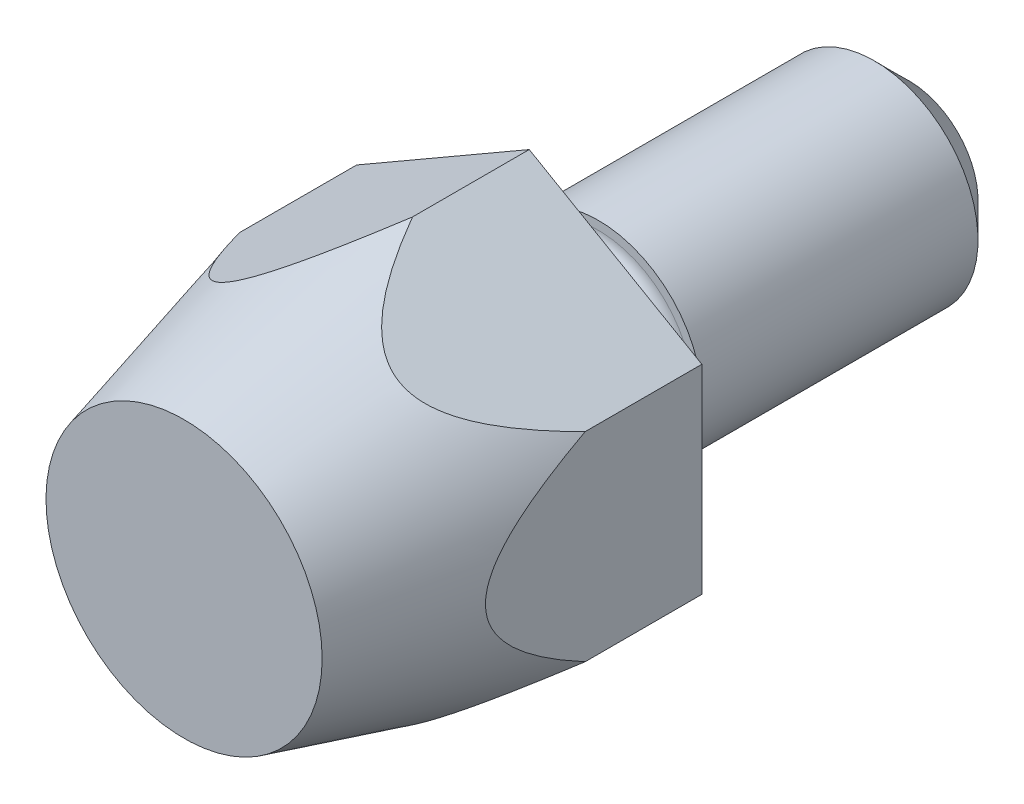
ISO-10303-21;
HEADER;
FILE_DESCRIPTION(('STEP AP214'),'2;1');
FILE_NAME('part.step','',(''),(''),'','','');
FILE_SCHEMA(('AUTOMOTIVE_DESIGN { 1 0 10303 214 1 1 1 1 }'));
ENDSEC;
DATA;
#1=APPLICATION_CONTEXT('core data for automotive mechanical design processes');
#2=APPLICATION_PROTOCOL_DEFINITION('international standard','automotive_design',2000,#1);
#3=PRODUCT_CONTEXT('',#1,'mechanical');
#4=PRODUCT('Part','Part','',(#3));
#5=PRODUCT_RELATED_PRODUCT_CATEGORY('part','',(#4));
#6=PRODUCT_DEFINITION_FORMATION('','',#4);
#7=PRODUCT_DEFINITION_CONTEXT('part definition',#1,'design');
#8=PRODUCT_DEFINITION('design','',#6,#7);
#9=PRODUCT_DEFINITION_SHAPE('','',#8);
#10=(LENGTH_UNIT() NAMED_UNIT(*) SI_UNIT(.MILLI.,.METRE.));
#11=(NAMED_UNIT(*) PLANE_ANGLE_UNIT() SI_UNIT($,.RADIAN.));
#12=(NAMED_UNIT(*) SI_UNIT($,.STERADIAN.) SOLID_ANGLE_UNIT());
#13=UNCERTAINTY_MEASURE_WITH_UNIT(LENGTH_MEASURE(1.E-05),#10,'distance_accuracy_value','');
#14=(GEOMETRIC_REPRESENTATION_CONTEXT(3) GLOBAL_UNCERTAINTY_ASSIGNED_CONTEXT((#13)) GLOBAL_UNIT_ASSIGNED_CONTEXT((#10,
#11,#12)) REPRESENTATION_CONTEXT('',''));
#15=CARTESIAN_POINT('',(0.,0.,0.));
#16=DIRECTION('',(0.,0.,1.));
#17=DIRECTION('',(1.,0.,0.));
#18=AXIS2_PLACEMENT_3D('',#15,#16,#17);
#19=CARTESIAN_POINT('',(-6.67949192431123,0.,0.));
#20=DIRECTION('',(0.,0.,-1.));
#21=DIRECTION('',(-1.,0.,0.));
#22=AXIS2_PLACEMENT_3D('',#19,#20,#21);
#23=PLANE('',#22);
#24=CARTESIAN_POINT('',(0.,0.,0.));
#25=DIRECTION('',(0.,0.,-1.));
#26=DIRECTION('',(-1.,0.,0.));
#27=AXIS2_PLACEMENT_3D('',#24,#25,#26);
#28=CIRCLE('',#27,2.75);
#29=CARTESIAN_POINT('',(-2.75,0.,0.));
#30=VERTEX_POINT('',#29);
#31=EDGE_CURVE('E9',#30,#30,#28,.F.);
#32=ORIENTED_EDGE('',*,*,#31,.T.);
#33=EDGE_LOOP('',(#32));
#34=FACE_BOUND('',#33,.T.);
#35=DIRECTION('',(0.,1.,0.));
#36=VECTOR('',#35,1.);
#37=CARTESIAN_POINT('',(5.,-2.88675134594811,0.));
#38=LINE('',#37,#36);
#39=CARTESIAN_POINT('',(5.,-2.88675134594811,0.));
#40=VERTEX_POINT('',#39);
#41=CARTESIAN_POINT('',(5.,2.88675134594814,0.));
#42=VERTEX_POINT('',#41);
#43=EDGE_CURVE('E97',#40,#42,#38,.T.);
#44=ORIENTED_EDGE('',*,*,#43,.F.);
#45=DIRECTION('',(-0.866025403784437,-0.5,0.));
#46=VECTOR('',#45,1.);
#47=CARTESIAN_POINT('',(5.,-2.88675134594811,0.));
#48=LINE('',#47,#46);
#49=CARTESIAN_POINT('',(0.,-5.77350269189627,0.));
#50=VERTEX_POINT('',#49);
#51=EDGE_CURVE('E90',#40,#50,#48,.T.);
#52=ORIENTED_EDGE('',*,*,#51,.T.);
#53=DIRECTION('',(0.866025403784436,-0.5,0.));
#54=VECTOR('',#53,1.);
#55=CARTESIAN_POINT('',(-5.,-2.88675134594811,0.));
#56=LINE('',#55,#54);
#57=CARTESIAN_POINT('',(-5.,-2.88675134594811,0.));
#58=VERTEX_POINT('',#57);
#59=EDGE_CURVE('E88',#58,#50,#56,.T.);
#60=ORIENTED_EDGE('',*,*,#59,.F.);
#61=DIRECTION('',(0.,1.,0.));
#62=VECTOR('',#61,1.);
#63=CARTESIAN_POINT('',(-5.,-2.88675134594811,0.));
#64=LINE('',#63,#62);
#65=CARTESIAN_POINT('',(-5.,2.88675134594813,0.));
#66=VERTEX_POINT('',#65);
#67=EDGE_CURVE('E37',#58,#66,#64,.T.);
#68=ORIENTED_EDGE('',*,*,#67,.T.);
#69=DIRECTION('',(0.86602540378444,0.5,0.));
#70=VECTOR('',#69,1.);
#71=CARTESIAN_POINT('',(-5.,2.88675134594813,0.));
#72=LINE('',#71,#70);
#73=CARTESIAN_POINT('',(0.,5.77350269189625,0.));
#74=VERTEX_POINT('',#73);
#75=EDGE_CURVE('E77',#66,#74,#72,.T.);
#76=ORIENTED_EDGE('',*,*,#75,.T.);
#77=DIRECTION('',(-0.86602540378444,0.5,0.));
#78=VECTOR('',#77,1.);
#79=CARTESIAN_POINT('',(5.,2.88675134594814,0.));
#80=LINE('',#79,#78);
#81=EDGE_CURVE('E83',#42,#74,#80,.T.);
#82=ORIENTED_EDGE('',*,*,#81,.F.);
#83=EDGE_LOOP('',(#44,#52,#60,#68,#76,#82));
#84=FACE_BOUND('',#83,.T.);
#85=ADVANCED_FACE('F14',(#34,#84),#23,.T.);
#86=CARTESIAN_POINT('',(5.,-2.88675134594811,10.));
#87=DIRECTION('',(0.5,-0.866025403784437,0.));
#88=DIRECTION('',(0.866025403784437,0.5,0.));
#89=AXIS2_PLACEMENT_3D('',#86,#87,#88);
#90=PLANE('',#89);
#91=DIRECTION('',(0.,0.,-1.));
#92=VECTOR('',#91,1.);
#93=CARTESIAN_POINT('',(0.,-5.77350269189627,10.));
#94=LINE('',#93,#92);
#95=CARTESIAN_POINT('',(1.0797276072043E-13,-5.77350269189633,3.38119784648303));
#96=VERTEX_POINT('',#95);
#97=EDGE_CURVE('E29',#96,#50,#94,.T.);
#98=ORIENTED_EDGE('',*,*,#97,.T.);
#99=ORIENTED_EDGE('',*,*,#51,.F.);
#100=DIRECTION('',(0.,0.,-1.));
#101=VECTOR('',#100,1.);
#102=CARTESIAN_POINT('',(5.,-2.88675134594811,10.));
#103=LINE('',#102,#101);
#104=CARTESIAN_POINT('',(5.,-2.88675134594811,3.38119784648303));
#105=VERTEX_POINT('',#104);
#106=EDGE_CURVE('E102',#105,#40,#103,.T.);
#107=ORIENTED_EDGE('',*,*,#106,.F.);
#108=CARTESIAN_POINT('',(-0.000200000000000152,-5.77361816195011,3.38076689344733));
#109=CARTESIAN_POINT('',(0.0666130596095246,-5.73504362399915,3.52459966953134));
#110=CARTESIAN_POINT('',(0.134906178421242,-5.6956145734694,3.66756113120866));
#111=CARTESIAN_POINT('',(0.275434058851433,-5.61448076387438,3.9512236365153));
#112=CARTESIAN_POINT('',(0.347675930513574,-5.57277189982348,4.09191996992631));
#113=CARTESIAN_POINT('',(0.497724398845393,-5.48614137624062,4.3716408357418));
#114=CARTESIAN_POINT('',(0.575586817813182,-5.4411874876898,4.51062576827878));
#115=CARTESIAN_POINT('',(0.737356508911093,-5.34778971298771,4.78371916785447));
#116=CARTESIAN_POINT('',(0.82125889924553,-5.29934864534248,4.91783144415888));
#117=CARTESIAN_POINT('',(0.992140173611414,-5.20069029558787,5.17179045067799));
#118=CARTESIAN_POINT('',(1.07869243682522,-5.15071932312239,5.29201594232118));
#119=CARTESIAN_POINT('',(1.2610601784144,-5.04542925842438,5.5228063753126));
#120=CARTESIAN_POINT('',(1.35686724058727,-4.99011502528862,5.63337992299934));
#121=CARTESIAN_POINT('',(1.53855912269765,-4.88521516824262,5.81643057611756));
#122=CARTESIAN_POINT('',(1.62209200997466,-4.83698743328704,5.89196980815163));
#123=CARTESIAN_POINT('',(1.79796539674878,-4.73544688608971,6.02794447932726));
#124=CARTESIAN_POINT('',(1.89027927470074,-4.68214944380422,6.08842367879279));
#125=CARTESIAN_POINT('',(2.05171533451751,-4.58894429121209,6.17025464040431));
#126=CARTESIAN_POINT('',(2.11839657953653,-4.55044585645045,6.19793134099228));
#127=CARTESIAN_POINT('',(2.2547866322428,-4.4717010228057,6.24034007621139));
#128=CARTESIAN_POINT('',(2.3244912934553,-4.4314570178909,6.25508928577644));
#129=CARTESIAN_POINT('',(2.4655045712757,-4.35004296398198,6.26983805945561));
#130=CARTESIAN_POINT('',(2.53682005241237,-4.30886895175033,6.26975331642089));
#131=CARTESIAN_POINT('',(2.67824468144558,-4.22721740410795,6.25463898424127));
#132=CARTESIAN_POINT('',(2.74835306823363,-4.18674030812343,6.23960029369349));
#133=CARTESIAN_POINT('',(2.89986836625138,-4.09926291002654,6.19195134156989));
#134=CARTESIAN_POINT('',(2.98054352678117,-4.05268508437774,6.15630643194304));
#135=CARTESIAN_POINT('',(3.13596876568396,-3.96295028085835,6.07071198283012));
#136=CARTESIAN_POINT('',(3.2107048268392,-3.91980139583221,6.02072981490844));
#137=CARTESIAN_POINT('',(3.34625548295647,-3.84154118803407,5.91684973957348));
#138=CARTESIAN_POINT('',(3.4076932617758,-3.80607006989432,5.86400940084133));
#139=CARTESIAN_POINT('',(3.5264663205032,-3.73749641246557,5.75244799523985));
#140=CARTESIAN_POINT('',(3.58379786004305,-3.70439603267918,5.69372168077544));
#141=CARTESIAN_POINT('',(3.69525082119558,-3.64004863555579,5.57150783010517));
#142=CARTESIAN_POINT('',(3.74934683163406,-3.60881628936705,5.507989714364));
#143=CARTESIAN_POINT('',(3.85438937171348,-3.54816995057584,5.37764665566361));
#144=CARTESIAN_POINT('',(3.90533715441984,-3.51875523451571,5.31082304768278));
#145=CARTESIAN_POINT('',(4.06016343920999,-3.42936623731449,5.09835259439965));
#146=CARTESIAN_POINT('',(4.15942927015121,-3.37205508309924,4.94823125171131));
#147=CARTESIAN_POINT('',(4.34940257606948,-3.26237394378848,4.64077064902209));
#148=CARTESIAN_POINT('',(4.44009696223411,-3.21001151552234,4.48342087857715));
#149=CARTESIAN_POINT('',(4.61166845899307,-3.11095466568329,4.16988404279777));
#150=CARTESIAN_POINT('',(4.69278505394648,-3.06412197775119,4.01387074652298));
#151=CARTESIAN_POINT('',(4.81073224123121,-2.9960251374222,3.77774151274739));
#152=CARTESIAN_POINT('',(4.84936626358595,-2.97371977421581,3.69881159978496));
#153=CARTESIAN_POINT('',(4.9255584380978,-2.92973020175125,3.54027498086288));
#154=CARTESIAN_POINT('',(4.96311672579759,-2.90804591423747,3.46066836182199));
#155=CARTESIAN_POINT('',(5.00020000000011,-2.88663587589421,3.38076689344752));
#156=B_SPLINE_CURVE_WITH_KNOTS('',3,(#108,#109,#110,#111,#112,#113,#114,#115,#116,#117,#118,
#119,#120,#121,#122,#123,#124,#125,#126,#127,#128,#129,#130,#131,#132,#133,#134,#135,#136,#137,
#138,#139,#140,#141,#142,#143,#144,#145,#146,#147,#148,#149,#150,#151,#152,#153,#154,#155),
.UNSPECIFIED.,.F.,.F.,(4,2,2,2,2,2,2,2,2,2,2,2,2,2,2,2,2,2,2,2,2,2,2,4),(0.,0.489700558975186,
0.980313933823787,1.47674422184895,1.97277768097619,2.44138411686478,2.90956834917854,
3.27625130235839,3.64185600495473,3.88641289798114,4.13064438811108,4.37626398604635,
4.62203316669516,4.91958488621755,5.21781921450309,5.48280887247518,5.74803691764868,
6.01513022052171,6.28211652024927,6.84806715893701,7.41486850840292,7.96062387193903,
8.23260942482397,8.50456055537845),.UNSPECIFIED.);
#157=EDGE_CURVE('E157',#96,#105,#156,.T.);
#158=ORIENTED_EDGE('',*,*,#157,.F.);
#159=EDGE_LOOP('',(#98,#99,#107,#158));
#160=FACE_BOUND('',#159,.T.);
#161=ADVANCED_FACE('F127',(#160),#90,.T.);
#162=CARTESIAN_POINT('',(5.,-2.88675134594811,10.));
#163=DIRECTION('',(-1.,0.,0.));
#164=DIRECTION('',(0.,0.,1.));
#165=AXIS2_PLACEMENT_3D('',#162,#163,#164);
#166=PLANE('',#165);
#167=CARTESIAN_POINT('',(5.,-5.43759859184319,-2.64038268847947));
#168=CARTESIAN_POINT('',(5.,-5.33159199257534,-2.34924078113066));
#169=CARTESIAN_POINT('',(5.,-5.22437744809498,-2.05853169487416));
#170=CARTESIAN_POINT('',(5.,-5.00694392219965,-1.4781677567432));
#171=CARTESIAN_POINT('',(5.,-4.89672428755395,-1.18851314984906));
#172=CARTESIAN_POINT('',(5.,-4.67173562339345,-0.607988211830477));
#173=CARTESIAN_POINT('',(5.,-4.55693470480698,-0.317130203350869));
#174=CARTESIAN_POINT('',(5.,-4.32292298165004,0.262763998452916));
#175=CARTESIAN_POINT('',(5.,-4.20371280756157,0.551800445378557));
#176=CARTESIAN_POINT('',(5.,-3.94781512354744,1.1557525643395));
#177=CARTESIAN_POINT('',(5.,-3.81055972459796,1.47042851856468));
#178=CARTESIAN_POINT('',(5.,-3.52724077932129,2.09601172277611));
#179=CARTESIAN_POINT('',(5.,-3.38117322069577,2.40691717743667));
#180=CARTESIAN_POINT('',(5.,-3.1533346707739,2.86817931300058));
#181=CARTESIAN_POINT('',(5.,-3.07609984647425,3.02077573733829));
#182=CARTESIAN_POINT('',(5.,-2.91802717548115,3.32408605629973));
#183=CARTESIAN_POINT('',(5.,-2.83718958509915,3.47480008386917));
#184=CARTESIAN_POINT('',(5.,-2.67120088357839,3.77368508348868));
#185=CARTESIAN_POINT('',(5.,-2.58605328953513,3.92185800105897));
#186=CARTESIAN_POINT('',(5.,-2.41035297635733,4.21494826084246));
#187=CARTESIAN_POINT('',(5.,-2.31980151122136,4.35986634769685));
#188=CARTESIAN_POINT('',(5.,-2.1584677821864,4.60472431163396));
#189=CARTESIAN_POINT('',(5.,-2.0893612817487,4.70576516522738));
#190=CARTESIAN_POINT('',(5.,-1.94683529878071,4.90485828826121));
#191=CARTESIAN_POINT('',(5.,-1.87341365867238,5.0029090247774));
#192=CARTESIAN_POINT('',(5.,-1.72191680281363,5.1941749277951));
#193=CARTESIAN_POINT('',(5.,-1.64388103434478,5.28742108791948));
#194=CARTESIAN_POINT('',(5.,-1.48150152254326,5.46820229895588));
#195=CARTESIAN_POINT('',(5.,-1.3971629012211,5.55574188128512));
#196=CARTESIAN_POINT('',(5.,-1.22948130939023,5.71422147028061));
#197=CARTESIAN_POINT('',(5.,-1.1468889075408,5.78594563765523));
#198=CARTESIAN_POINT('',(5.,-0.974040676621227,5.91978391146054));
#199=CARTESIAN_POINT('',(5.,-0.883784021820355,5.98189698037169));
#200=CARTESIAN_POINT('',(5.,-0.709139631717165,6.08351880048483));
#201=CARTESIAN_POINT('',(5.,-0.625939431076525,6.12502736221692));
#202=CARTESIAN_POINT('',(5.,-0.453877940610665,6.19392204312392));
#203=CARTESIAN_POINT('',(5.,-0.365029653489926,6.22133936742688));
#204=CARTESIAN_POINT('',(5.,-0.198821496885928,6.25532265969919));
#205=CARTESIAN_POINT('',(5.,-0.122026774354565,6.26460989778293));
#206=CARTESIAN_POINT('',(5.,0.0320247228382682,6.26977696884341));
#207=CARTESIAN_POINT('',(5.,0.109281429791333,6.26565872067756));
#208=CARTESIAN_POINT('',(5.,0.261702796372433,6.24456651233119));
#209=CARTESIAN_POINT('',(5.,0.336873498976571,6.22763486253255));
#210=CARTESIAN_POINT('',(5.,0.483805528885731,6.1827949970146));
#211=CARTESIAN_POINT('',(5.,0.55556503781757,6.1548809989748));
#212=CARTESIAN_POINT('',(5.,0.741388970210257,6.0688402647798));
#213=CARTESIAN_POINT('',(5.,0.851830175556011,6.00296920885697));
#214=CARTESIAN_POINT('',(5.,1.06188273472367,5.85568028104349));
#215=CARTESIAN_POINT('',(5.,1.16144797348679,5.77419995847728));
#216=CARTESIAN_POINT('',(5.,1.38762216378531,5.56850784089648));
#217=CARTESIAN_POINT('',(5.,1.51010841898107,5.43983257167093));
#218=CARTESIAN_POINT('',(5.,1.74254260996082,5.1714840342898));
#219=CARTESIAN_POINT('',(5.,1.85246162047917,5.03178659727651));
#220=CARTESIAN_POINT('',(5.,2.06415788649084,4.74373077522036));
#221=CARTESIAN_POINT('',(5.,2.16581693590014,4.59528630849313));
#222=CARTESIAN_POINT('',(5.,2.31270345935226,4.36916533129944));
#223=CARTESIAN_POINT('',(5.,2.3607070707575,4.29325869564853));
#224=CARTESIAN_POINT('',(5.,2.45508219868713,4.14043910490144));
#225=CARTESIAN_POINT('',(5.,2.50145377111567,4.06352618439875));
#226=CARTESIAN_POINT('',(5.,2.65411924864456,3.80491855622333));
#227=CARTESIAN_POINT('',(5.,2.75719091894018,3.6213201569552));
#228=CARTESIAN_POINT('',(5.,2.95726604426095,3.25083273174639));
#229=CARTESIAN_POINT('',(5.,3.05426825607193,3.06394304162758));
#230=CARTESIAN_POINT('',(5.,3.24349065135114,2.68761699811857));
#231=CARTESIAN_POINT('',(5.,3.33570774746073,2.49817909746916));
#232=CARTESIAN_POINT('',(5.,3.51619661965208,2.11742858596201));
#233=CARTESIAN_POINT('',(5.,3.60446817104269,1.92611586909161));
#234=CARTESIAN_POINT('',(5.,3.86502344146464,1.3486350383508));
#235=CARTESIAN_POINT('',(5.,4.0323940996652,0.96025133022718));
#236=CARTESIAN_POINT('',(5.,4.35773215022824,0.179778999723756));
#237=CARTESIAN_POINT('',(5.,4.51570303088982,-0.212308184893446));
#238=CARTESIAN_POINT('',(5.,4.80659275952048,-0.953350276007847));
#239=CARTESIAN_POINT('',(5.,4.94028472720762,-1.30200275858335));
#240=CARTESIAN_POINT('',(5.,5.20328941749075,-2.00099589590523));
#241=CARTESIAN_POINT('',(5.,5.33260164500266,-2.35133673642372));
#242=CARTESIAN_POINT('',(5.,5.58675089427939,-3.05084408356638));
#243=CARTESIAN_POINT('',(5.,5.71161301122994,-3.4000014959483));
#244=CARTESIAN_POINT('',(5.,5.95835814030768,-4.09930336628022));
#245=CARTESIAN_POINT('',(5.,6.08024164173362,-4.44944765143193));
#246=CARTESIAN_POINT('',(5.,6.20093045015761,-4.79999756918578));
#247=B_SPLINE_CURVE_WITH_KNOTS('',3,(#167,#168,#169,#170,#171,#172,#173,#174,#175,#176,#177,
#178,#179,#180,#181,#182,#183,#184,#185,#186,#187,#188,#189,#190,#191,#192,#193,#194,#195,#196,
#197,#198,#199,#200,#201,#202,#203,#204,#205,#206,#207,#208,#209,#210,#211,#212,#213,#214,#215,
#216,#217,#218,#219,#220,#221,#222,#223,#224,#225,#226,#227,#228,#229,#230,#231,#232,#233,#234,
#235,#236,#237,#238,#239,#240,#241,#242,#243,#244,#245,#246),.UNSPECIFIED.,.F.,.F.,(4,2,2,2,2,2,
2,2,2,2,2,2,2,2,2,2,2,2,2,2,2,2,2,2,2,2,2,2,2,2,2,2,2,2,2,2,2,2,2,4),(0.,0.929528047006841,
1.85925978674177,2.797312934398,3.73523246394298,4.76506737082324,5.79537476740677,
6.30842488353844,6.82143855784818,7.33404014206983,7.84652323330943,8.2136766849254,
8.58101530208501,8.94557238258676,9.30983636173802,9.63751943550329,9.96523785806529,
10.2432294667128,10.52060277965,10.7515660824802,10.9824963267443,11.2126673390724,
11.4429597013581,11.8264923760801,12.211592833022,12.7432062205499,13.2760195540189,
13.8154567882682,14.0848789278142,14.3542918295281,14.9857757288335,15.6173885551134,
16.2494039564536,16.8814553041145,18.14999338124,19.4180577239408,20.5382394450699,
21.658547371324,22.770968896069,23.8832064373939),.UNSPECIFIED.);
#248=CARTESIAN_POINT('',(5.,2.88675134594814,3.38119784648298));
#249=VERTEX_POINT('',#248);
#250=EDGE_CURVE('E151',#249,#105,#247,.F.);
#251=ORIENTED_EDGE('',*,*,#250,.T.);
#252=ORIENTED_EDGE('',*,*,#106,.T.);
#253=ORIENTED_EDGE('',*,*,#43,.T.);
#254=DIRECTION('',(0.,0.,-1.));
#255=VECTOR('',#254,1.);
#256=CARTESIAN_POINT('',(5.,2.88675134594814,10.));
#257=LINE('',#256,#255);
#258=EDGE_CURVE('E100',#249,#42,#257,.T.);
#259=ORIENTED_EDGE('',*,*,#258,.F.);
#260=EDGE_LOOP('',(#251,#252,#253,#259));
#261=FACE_BOUND('',#260,.T.);
#262=ADVANCED_FACE('F163',(#261),#166,.F.);
#263=CARTESIAN_POINT('',(5.,2.88675134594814,10.));
#264=DIRECTION('',(-0.5,-0.86602540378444,0.));
#265=DIRECTION('',(0.86602540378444,-0.5,0.));
#266=AXIS2_PLACEMENT_3D('',#263,#264,#265);
#267=PLANE('',#266);
#268=CARTESIAN_POINT('',(-0.000199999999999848,5.77361816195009,3.3807668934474));
#269=CARTESIAN_POINT('',(0.0666130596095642,5.73504362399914,3.52459966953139));
#270=CARTESIAN_POINT('',(0.134906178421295,5.69561457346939,3.66756113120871));
#271=CARTESIAN_POINT('',(0.275434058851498,5.61448076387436,3.95122363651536));
#272=CARTESIAN_POINT('',(0.347675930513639,5.57277189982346,4.09191996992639));
#273=CARTESIAN_POINT('',(0.497724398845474,5.48614137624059,4.37164083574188));
#274=CARTESIAN_POINT('',(0.575586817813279,5.44118748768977,4.51062576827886));
#275=CARTESIAN_POINT('',(0.737356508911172,5.34778971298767,4.78371916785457));
#276=CARTESIAN_POINT('',(0.821258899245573,5.29934864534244,4.91783144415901));
#277=CARTESIAN_POINT('',(0.992140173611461,5.20069029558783,5.17179045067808));
#278=CARTESIAN_POINT('',(1.0786924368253,5.15071932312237,5.29201594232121));
#279=CARTESIAN_POINT('',(1.26106017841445,5.04542925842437,5.5228063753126));
#280=CARTESIAN_POINT('',(1.35686724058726,4.99011502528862,5.63337992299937));
#281=CARTESIAN_POINT('',(1.53855912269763,4.88521516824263,5.81643057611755));
#282=CARTESIAN_POINT('',(1.62209200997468,4.83698743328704,5.89196980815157));
#283=CARTESIAN_POINT('',(1.79796539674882,4.7354468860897,6.02794447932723));
#284=CARTESIAN_POINT('',(1.89027927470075,4.68214944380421,6.08842367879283));
#285=CARTESIAN_POINT('',(2.05171533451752,4.58894429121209,6.17025464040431));
#286=CARTESIAN_POINT('',(2.11839657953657,4.55044585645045,6.19793134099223));
#287=CARTESIAN_POINT('',(2.25478663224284,4.47170102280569,6.24034007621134));
#288=CARTESIAN_POINT('',(2.32449129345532,4.43145701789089,6.25508928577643));
#289=CARTESIAN_POINT('',(2.4655045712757,4.35004296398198,6.2698380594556));
#290=CARTESIAN_POINT('',(2.53682005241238,4.30886895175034,6.26975331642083));
#291=CARTESIAN_POINT('',(2.6782446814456,4.22721740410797,6.2546389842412));
#292=CARTESIAN_POINT('',(2.74835306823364,4.18674030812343,6.23960029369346));
#293=CARTESIAN_POINT('',(2.89986836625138,4.09926291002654,6.19195134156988));
#294=CARTESIAN_POINT('',(2.98054352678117,4.05268508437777,6.15630643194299));
#295=CARTESIAN_POINT('',(3.13596876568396,3.96295028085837,6.07071198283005));
#296=CARTESIAN_POINT('',(3.21070482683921,3.91980139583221,6.0207298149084));
#297=CARTESIAN_POINT('',(3.34625548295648,3.84154118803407,5.91684973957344));
#298=CARTESIAN_POINT('',(3.40769326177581,3.80607006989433,5.86400940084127));
#299=CARTESIAN_POINT('',(3.52646632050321,3.73749641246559,5.75244799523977));
#300=CARTESIAN_POINT('',(3.58379786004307,3.7043960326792,5.69372168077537));
#301=CARTESIAN_POINT('',(3.6952508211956,3.6400486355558,5.57150783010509));
#302=CARTESIAN_POINT('',(3.74934683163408,3.60881628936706,5.50798971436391));
#303=CARTESIAN_POINT('',(3.85438937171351,3.54816995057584,5.37764665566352));
#304=CARTESIAN_POINT('',(3.90533715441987,3.51875523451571,5.3108230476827));
#305=CARTESIAN_POINT('',(4.06016343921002,3.42936623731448,5.09835259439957));
#306=CARTESIAN_POINT('',(4.15942927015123,3.37205508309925,4.94823125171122));
#307=CARTESIAN_POINT('',(4.34940257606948,3.2623739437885,4.64077064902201));
#308=CARTESIAN_POINT('',(4.44009696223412,3.21001151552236,4.48342087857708));
#309=CARTESIAN_POINT('',(4.61166845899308,3.11095466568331,4.16988404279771));
#310=CARTESIAN_POINT('',(4.69278505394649,3.06412197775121,4.01387074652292));
#311=CARTESIAN_POINT('',(4.81073224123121,2.99602513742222,3.77774151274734));
#312=CARTESIAN_POINT('',(4.84936626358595,2.97371977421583,3.69881159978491));
#313=CARTESIAN_POINT('',(4.9255584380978,2.92973020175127,3.54027498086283));
#314=CARTESIAN_POINT('',(4.96311672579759,2.90804591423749,3.46066836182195));
#315=CARTESIAN_POINT('',(5.00020000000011,2.88663587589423,3.38076689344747));
#316=B_SPLINE_CURVE_WITH_KNOTS('',3,(#268,#269,#270,#271,#272,#273,#274,#275,#276,#277,#278,
#279,#280,#281,#282,#283,#284,#285,#286,#287,#288,#289,#290,#291,#292,#293,#294,#295,#296,#297,
#298,#299,#300,#301,#302,#303,#304,#305,#306,#307,#308,#309,#310,#311,#312,#313,#314,#315),
.UNSPECIFIED.,.F.,.F.,(4,2,2,2,2,2,2,2,2,2,2,2,2,2,2,2,2,2,2,2,2,2,2,4),(0.,0.489700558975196,
0.980313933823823,1.476744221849,1.97277768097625,2.44138411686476,2.90956834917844,
3.27625130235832,3.64185600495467,3.88641289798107,4.130644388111,4.37626398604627,
4.62203316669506,4.91958488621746,5.217819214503,5.4828088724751,5.74803691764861,
6.01513022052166,6.28211652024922,6.84806715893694,7.41486850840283,7.96062387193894,
8.23260942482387,8.50456055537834),.UNSPECIFIED.);
#317=CARTESIAN_POINT('',(0.,5.77350269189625,3.38119784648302));
#318=VERTEX_POINT('',#317);
#319=EDGE_CURVE('E145',#318,#249,#316,.T.);
#320=ORIENTED_EDGE('',*,*,#319,.T.);
#321=ORIENTED_EDGE('',*,*,#258,.T.);
#322=ORIENTED_EDGE('',*,*,#81,.T.);
#323=DIRECTION('',(0.,0.,-1.));
#324=VECTOR('',#323,1.);
#325=CARTESIAN_POINT('',(0.,5.77350269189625,10.));
#326=LINE('',#325,#324);
#327=EDGE_CURVE('E73',#318,#74,#326,.T.);
#328=ORIENTED_EDGE('',*,*,#327,.F.);
#329=EDGE_LOOP('',(#320,#321,#322,#328));
#330=FACE_BOUND('',#329,.T.);
#331=ADVANCED_FACE('F136',(#330),#267,.F.);
#332=CARTESIAN_POINT('',(-5.,2.88675134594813,10.));
#333=DIRECTION('',(-0.5,0.86602540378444,0.));
#334=DIRECTION('',(-0.86602540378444,-0.5,0.));
#335=AXIS2_PLACEMENT_3D('',#332,#333,#334);
#336=PLANE('',#335);
#337=ORIENTED_EDGE('',*,*,#327,.T.);
#338=ORIENTED_EDGE('',*,*,#75,.F.);
#339=DIRECTION('',(0.,0.,-1.));
#340=VECTOR('',#339,1.);
#341=CARTESIAN_POINT('',(-5.,2.88675134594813,10.));
#342=LINE('',#341,#340);
#343=CARTESIAN_POINT('',(-5.,2.88675134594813,3.38119784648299));
#344=VERTEX_POINT('',#343);
#345=EDGE_CURVE('E66',#344,#66,#342,.T.);
#346=ORIENTED_EDGE('',*,*,#345,.F.);
#347=CARTESIAN_POINT('',(0.000200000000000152,5.77361816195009,3.3807668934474));
#348=CARTESIAN_POINT('',(-0.0666130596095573,5.73504362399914,3.52459966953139));
#349=CARTESIAN_POINT('',(-0.134906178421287,5.69561457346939,3.66756113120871));
#350=CARTESIAN_POINT('',(-0.275434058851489,5.61448076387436,3.95122363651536));
#351=CARTESIAN_POINT('',(-0.347675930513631,5.57277189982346,4.09191996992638));
#352=CARTESIAN_POINT('',(-0.497724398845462,5.48614137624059,4.37164083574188));
#353=CARTESIAN_POINT('',(-0.575586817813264,5.44118748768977,4.51062576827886));
#354=CARTESIAN_POINT('',(-0.737356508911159,5.34778971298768,4.78371916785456));
#355=CARTESIAN_POINT('',(-0.821258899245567,5.29934864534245,4.917831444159));
#356=CARTESIAN_POINT('',(-0.992140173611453,5.20069029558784,5.17179045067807));
#357=CARTESIAN_POINT('',(-1.07869243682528,5.15071932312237,5.29201594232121));
#358=CARTESIAN_POINT('',(-1.26106017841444,5.04542925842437,5.5228063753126));
#359=CARTESIAN_POINT('',(-1.35686724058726,4.99011502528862,5.63337992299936));
#360=CARTESIAN_POINT('',(-1.53855912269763,4.88521516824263,5.81643057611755));
#361=CARTESIAN_POINT('',(-1.62209200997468,4.83698743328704,5.89196980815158));
#362=CARTESIAN_POINT('',(-1.79796539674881,4.7354468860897,6.02794447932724));
#363=CARTESIAN_POINT('',(-1.89027927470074,4.68214944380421,6.08842367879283));
#364=CARTESIAN_POINT('',(-2.05171533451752,4.58894429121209,6.17025464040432));
#365=CARTESIAN_POINT('',(-2.11839657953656,4.55044585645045,6.19793134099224));
#366=CARTESIAN_POINT('',(-2.25478663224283,4.4717010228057,6.24034007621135));
#367=CARTESIAN_POINT('',(-2.32449129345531,4.43145701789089,6.25508928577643));
#368=CARTESIAN_POINT('',(-2.4655045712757,4.35004296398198,6.2698380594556));
#369=CARTESIAN_POINT('',(-2.53682005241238,4.30886895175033,6.26975331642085));
#370=CARTESIAN_POINT('',(-2.67824468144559,4.22721740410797,6.25463898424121));
#371=CARTESIAN_POINT('',(-2.74835306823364,4.18674030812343,6.23960029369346));
#372=CARTESIAN_POINT('',(-2.89986836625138,4.09926291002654,6.19195134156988));
#373=CARTESIAN_POINT('',(-2.98054352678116,4.05268508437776,6.156306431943));
#374=CARTESIAN_POINT('',(-3.13596876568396,3.96295028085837,6.07071198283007));
#375=CARTESIAN_POINT('',(-3.2107048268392,3.91980139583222,6.02072981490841));
#376=CARTESIAN_POINT('',(-3.34625548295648,3.84154118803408,5.91684973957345));
#377=CARTESIAN_POINT('',(-3.4076932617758,3.80607006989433,5.86400940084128));
#378=CARTESIAN_POINT('',(-3.52646632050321,3.73749641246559,5.75244799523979));
#379=CARTESIAN_POINT('',(-3.58379786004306,3.7043960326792,5.69372168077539));
#380=CARTESIAN_POINT('',(-3.6952508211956,3.6400486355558,5.57150783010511));
#381=CARTESIAN_POINT('',(-3.74934683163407,3.60881628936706,5.50798971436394));
#382=CARTESIAN_POINT('',(-3.8543893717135,3.54816995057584,5.37764665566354));
#383=CARTESIAN_POINT('',(-3.90533715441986,3.51875523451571,5.31082304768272));
#384=CARTESIAN_POINT('',(-4.06016343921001,3.42936623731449,5.09835259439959));
#385=CARTESIAN_POINT('',(-4.15942927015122,3.37205508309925,4.94823125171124));
#386=CARTESIAN_POINT('',(-4.34940257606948,3.26237394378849,4.64077064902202));
#387=CARTESIAN_POINT('',(-4.44009696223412,3.21001151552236,4.48342087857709));
#388=CARTESIAN_POINT('',(-4.61166845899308,3.1109546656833,4.16988404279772));
#389=CARTESIAN_POINT('',(-4.69278505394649,3.06412197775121,4.01387074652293));
#390=CARTESIAN_POINT('',(-4.81073224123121,2.99602513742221,3.77774151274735));
#391=CARTESIAN_POINT('',(-4.84936626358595,2.97371977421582,3.69881159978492));
#392=CARTESIAN_POINT('',(-4.9255584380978,2.92973020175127,3.54027498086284));
#393=CARTESIAN_POINT('',(-4.96311672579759,2.90804591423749,3.46066836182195));
#394=CARTESIAN_POINT('',(-5.00020000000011,2.88663587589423,3.38076689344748));
#395=B_SPLINE_CURVE_WITH_KNOTS('',3,(#347,#348,#349,#350,#351,#352,#353,#354,#355,#356,#357,
#358,#359,#360,#361,#362,#363,#364,#365,#366,#367,#368,#369,#370,#371,#372,#373,#374,#375,#376,
#377,#378,#379,#380,#381,#382,#383,#384,#385,#386,#387,#388,#389,#390,#391,#392,#393,#394),
.UNSPECIFIED.,.F.,.F.,(4,2,2,2,2,2,2,2,2,2,2,2,2,2,2,2,2,2,2,2,2,2,2,4),(0.,0.489700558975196,
0.98031393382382,1.47674422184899,1.97277768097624,2.44138411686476,2.90956834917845,
3.27625130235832,3.64185600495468,3.88641289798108,4.13064438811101,4.37626398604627,
4.62203316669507,4.91958488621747,5.21781921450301,5.48280887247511,5.74803691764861,
6.01513022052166,6.28211652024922,6.84806715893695,7.41486850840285,7.96062387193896,
8.23260942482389,8.50456055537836),.UNSPECIFIED.);
#396=EDGE_CURVE('E139',#318,#344,#395,.T.);
#397=ORIENTED_EDGE('',*,*,#396,.F.);
#398=EDGE_LOOP('',(#337,#338,#346,#397));
#399=FACE_BOUND('',#398,.T.);
#400=ADVANCED_FACE('F78',(#399),#336,.T.);
#401=CARTESIAN_POINT('',(-5.,-2.88675134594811,10.));
#402=DIRECTION('',(-1.,0.,0.));
#403=DIRECTION('',(0.,0.,1.));
#404=AXIS2_PLACEMENT_3D('',#401,#402,#403);
#405=PLANE('',#404);
#406=ORIENTED_EDGE('',*,*,#345,.T.);
#407=ORIENTED_EDGE('',*,*,#67,.F.);
#408=DIRECTION('',(0.,0.,-1.));
#409=VECTOR('',#408,1.);
#410=CARTESIAN_POINT('',(-5.,-2.88675134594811,10.));
#411=LINE('',#410,#409);
#412=CARTESIAN_POINT('',(-5.,-2.88675134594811,3.38119784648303));
#413=VERTEX_POINT('',#412);
#414=EDGE_CURVE('E74',#413,#58,#411,.T.);
#415=ORIENTED_EDGE('',*,*,#414,.F.);
#416=CARTESIAN_POINT('',(-5.,-5.43759859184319,-2.64038268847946));
#417=CARTESIAN_POINT('',(-5.,-5.33159199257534,-2.34924078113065));
#418=CARTESIAN_POINT('',(-5.,-5.22437744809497,-2.05853169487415));
#419=CARTESIAN_POINT('',(-5.,-5.00694392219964,-1.4781677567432));
#420=CARTESIAN_POINT('',(-5.,-4.89672428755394,-1.18851314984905));
#421=CARTESIAN_POINT('',(-5.,-4.67173562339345,-0.607988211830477));
#422=CARTESIAN_POINT('',(-5.,-4.55693470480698,-0.317130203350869));
#423=CARTESIAN_POINT('',(-5.,-4.32292298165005,0.262763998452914));
#424=CARTESIAN_POINT('',(-5.,-4.20371280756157,0.551800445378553));
#425=CARTESIAN_POINT('',(-5.,-3.94781512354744,1.1557525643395));
#426=CARTESIAN_POINT('',(-5.,-3.81055972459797,1.47042851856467));
#427=CARTESIAN_POINT('',(-5.,-3.52724077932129,2.09601172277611));
#428=CARTESIAN_POINT('',(-5.,-3.38117322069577,2.40691717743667));
#429=CARTESIAN_POINT('',(-5.,-3.1533346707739,2.86817931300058));
#430=CARTESIAN_POINT('',(-5.,-3.07609984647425,3.02077573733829));
#431=CARTESIAN_POINT('',(-5.,-2.91802717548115,3.32408605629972));
#432=CARTESIAN_POINT('',(-5.,-2.83718958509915,3.47480008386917));
#433=CARTESIAN_POINT('',(-5.,-2.67120088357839,3.77368508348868));
#434=CARTESIAN_POINT('',(-5.,-2.58605328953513,3.92185800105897));
#435=CARTESIAN_POINT('',(-5.,-2.41035297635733,4.21494826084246));
#436=CARTESIAN_POINT('',(-5.,-2.31980151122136,4.35986634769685));
#437=CARTESIAN_POINT('',(-5.,-2.1584677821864,4.60472431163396));
#438=CARTESIAN_POINT('',(-5.,-2.08936128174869,4.70576516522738));
#439=CARTESIAN_POINT('',(-5.,-1.94683529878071,4.90485828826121));
#440=CARTESIAN_POINT('',(-5.,-1.87341365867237,5.0029090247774));
#441=CARTESIAN_POINT('',(-5.,-1.72191680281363,5.1941749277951));
#442=CARTESIAN_POINT('',(-5.,-1.64388103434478,5.28742108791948));
#443=CARTESIAN_POINT('',(-5.,-1.48150152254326,5.46820229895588));
#444=CARTESIAN_POINT('',(-5.,-1.3971629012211,5.55574188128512));
#445=CARTESIAN_POINT('',(-5.,-1.22948130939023,5.71422147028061));
#446=CARTESIAN_POINT('',(-5.,-1.1468889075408,5.78594563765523));
#447=CARTESIAN_POINT('',(-5.,-0.974040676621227,5.91978391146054));
#448=CARTESIAN_POINT('',(-5.,-0.883784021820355,5.98189698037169));
#449=CARTESIAN_POINT('',(-5.,-0.709139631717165,6.08351880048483));
#450=CARTESIAN_POINT('',(-5.,-0.625939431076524,6.12502736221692));
#451=CARTESIAN_POINT('',(-5.,-0.453877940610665,6.19392204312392));
#452=CARTESIAN_POINT('',(-5.,-0.365029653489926,6.22133936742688));
#453=CARTESIAN_POINT('',(-5.,-0.198821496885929,6.25532265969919));
#454=CARTESIAN_POINT('',(-5.,-0.122026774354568,6.26460989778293));
#455=CARTESIAN_POINT('',(-5.,0.0320247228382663,6.26977696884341));
#456=CARTESIAN_POINT('',(-5.,0.109281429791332,6.26565872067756));
#457=CARTESIAN_POINT('',(-5.,0.261702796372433,6.24456651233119));
#458=CARTESIAN_POINT('',(-5.,0.336873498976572,6.22763486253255));
#459=CARTESIAN_POINT('',(-5.,0.483805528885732,6.1827949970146));
#460=CARTESIAN_POINT('',(-5.,0.55556503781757,6.1548809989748));
#461=CARTESIAN_POINT('',(-5.,0.741388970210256,6.0688402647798));
#462=CARTESIAN_POINT('',(-5.,0.85183017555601,6.00296920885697));
#463=CARTESIAN_POINT('',(-5.,1.06188273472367,5.85568028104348));
#464=CARTESIAN_POINT('',(-5.,1.16144797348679,5.77419995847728));
#465=CARTESIAN_POINT('',(-5.,1.38762216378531,5.56850784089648));
#466=CARTESIAN_POINT('',(-5.,1.51010841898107,5.43983257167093));
#467=CARTESIAN_POINT('',(-5.,1.74254260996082,5.1714840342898));
#468=CARTESIAN_POINT('',(-5.,1.85246162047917,5.03178659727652));
#469=CARTESIAN_POINT('',(-5.,2.06415788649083,4.74373077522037));
#470=CARTESIAN_POINT('',(-5.,2.16581693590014,4.59528630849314));
#471=CARTESIAN_POINT('',(-5.,2.31270345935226,4.36916533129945));
#472=CARTESIAN_POINT('',(-5.,2.36070707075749,4.29325869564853));
#473=CARTESIAN_POINT('',(-5.,2.45508219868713,4.14043910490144));
#474=CARTESIAN_POINT('',(-5.,2.50145377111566,4.06352618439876));
#475=CARTESIAN_POINT('',(-5.,2.65411924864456,3.80491855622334));
#476=CARTESIAN_POINT('',(-5.,2.75719091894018,3.62132015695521));
#477=CARTESIAN_POINT('',(-5.,2.95726604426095,3.25083273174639));
#478=CARTESIAN_POINT('',(-5.,3.05426825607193,3.06394304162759));
#479=CARTESIAN_POINT('',(-5.,3.24349065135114,2.68761699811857));
#480=CARTESIAN_POINT('',(-5.,3.33570774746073,2.49817909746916));
#481=CARTESIAN_POINT('',(-5.,3.51619661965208,2.11742858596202));
#482=CARTESIAN_POINT('',(-5.,3.60446817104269,1.92611586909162));
#483=CARTESIAN_POINT('',(-5.,3.86502344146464,1.3486350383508));
#484=CARTESIAN_POINT('',(-5.,4.03239409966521,0.960251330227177));
#485=CARTESIAN_POINT('',(-5.,4.35773215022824,0.179778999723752));
#486=CARTESIAN_POINT('',(-5.,4.51570303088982,-0.21230818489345));
#487=CARTESIAN_POINT('',(-5.,4.80659275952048,-0.953350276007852));
#488=CARTESIAN_POINT('',(-5.,4.94028472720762,-1.30200275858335));
#489=CARTESIAN_POINT('',(-5.,5.20328941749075,-2.00099589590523));
#490=CARTESIAN_POINT('',(-5.,5.33260164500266,-2.35133673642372));
#491=CARTESIAN_POINT('',(-5.,5.58675089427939,-3.05084408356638));
#492=CARTESIAN_POINT('',(-5.,5.71161301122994,-3.4000014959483));
#493=CARTESIAN_POINT('',(-5.,5.95835814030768,-4.09930336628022));
#494=CARTESIAN_POINT('',(-5.,6.08024164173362,-4.44944765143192));
#495=CARTESIAN_POINT('',(-5.,6.20093045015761,-4.79999756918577));
#496=B_SPLINE_CURVE_WITH_KNOTS('',3,(#416,#417,#418,#419,#420,#421,#422,#423,#424,#425,#426,
#427,#428,#429,#430,#431,#432,#433,#434,#435,#436,#437,#438,#439,#440,#441,#442,#443,#444,#445,
#446,#447,#448,#449,#450,#451,#452,#453,#454,#455,#456,#457,#458,#459,#460,#461,#462,#463,#464,
#465,#466,#467,#468,#469,#470,#471,#472,#473,#474,#475,#476,#477,#478,#479,#480,#481,#482,#483,
#484,#485,#486,#487,#488,#489,#490,#491,#492,#493,#494,#495),.UNSPECIFIED.,.F.,.F.,(4,2,2,2,2,2,
2,2,2,2,2,2,2,2,2,2,2,2,2,2,2,2,2,2,2,2,2,2,2,2,2,2,2,2,2,2,2,2,2,4),(0.,0.929528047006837,
1.85925978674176,2.79731293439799,3.73523246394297,4.76506737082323,5.79537476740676,
6.30842488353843,6.82143855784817,7.33404014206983,7.84652323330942,8.2136766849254,
8.581015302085,8.94557238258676,9.30983636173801,9.63751943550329,9.96523785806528,
10.2432294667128,10.52060277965,10.7515660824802,10.9824963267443,11.2126673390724,
11.4429597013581,11.8264923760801,12.211592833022,12.7432062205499,13.2760195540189,
13.8154567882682,14.0848789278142,14.3542918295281,14.9857757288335,15.6173885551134,
16.2494039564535,16.8814553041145,18.14999338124,19.4180577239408,20.5382394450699,
21.658547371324,22.770968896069,23.8832064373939),.UNSPECIFIED.);
#497=EDGE_CURVE('E70',#344,#413,#496,.F.);
#498=ORIENTED_EDGE('',*,*,#497,.F.);
#499=EDGE_LOOP('',(#406,#407,#415,#498));
#500=FACE_BOUND('',#499,.T.);
#501=ADVANCED_FACE('F68',(#500),#405,.T.);
#502=CARTESIAN_POINT('',(-5.,-2.88675134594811,10.));
#503=DIRECTION('',(0.5,0.866025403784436,0.));
#504=DIRECTION('',(-0.866025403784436,0.5,0.));
#505=AXIS2_PLACEMENT_3D('',#502,#503,#504);
#506=PLANE('',#505);
#507=CARTESIAN_POINT('',(0.000199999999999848,-5.77361816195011,3.38076689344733));
#508=CARTESIAN_POINT('',(-0.0666130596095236,-5.73504362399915,3.52459966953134));
#509=CARTESIAN_POINT('',(-0.134906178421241,-5.6956145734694,3.66756113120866));
#510=CARTESIAN_POINT('',(-0.27543405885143,-5.61448076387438,3.9512236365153));
#511=CARTESIAN_POINT('',(-0.347675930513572,-5.57277189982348,4.09191996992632));
#512=CARTESIAN_POINT('',(-0.49772439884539,-5.48614137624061,4.3716408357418));
#513=CARTESIAN_POINT('',(-0.575586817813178,-5.4411874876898,4.51062576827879));
#514=CARTESIAN_POINT('',(-0.737356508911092,-5.34778971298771,4.78371916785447));
#515=CARTESIAN_POINT('',(-0.821258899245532,-5.29934864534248,4.91783144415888));
#516=CARTESIAN_POINT('',(-0.992140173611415,-5.20069029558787,5.17179045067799));
#517=CARTESIAN_POINT('',(-1.07869243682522,-5.15071932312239,5.29201594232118));
#518=CARTESIAN_POINT('',(-1.2610601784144,-5.04542925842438,5.52280637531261));
#519=CARTESIAN_POINT('',(-1.35686724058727,-4.99011502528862,5.63337992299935));
#520=CARTESIAN_POINT('',(-1.53855912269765,-4.88521516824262,5.81643057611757));
#521=CARTESIAN_POINT('',(-1.62209200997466,-4.83698743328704,5.89196980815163));
#522=CARTESIAN_POINT('',(-1.79796539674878,-4.7354468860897,6.02794447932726));
#523=CARTESIAN_POINT('',(-1.89027927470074,-4.68214944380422,6.0884236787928));
#524=CARTESIAN_POINT('',(-2.0517153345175,-4.58894429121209,6.17025464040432));
#525=CARTESIAN_POINT('',(-2.11839657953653,-4.55044585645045,6.19793134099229));
#526=CARTESIAN_POINT('',(-2.2547866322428,-4.4717010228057,6.2403400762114));
#527=CARTESIAN_POINT('',(-2.3244912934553,-4.4314570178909,6.25508928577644));
#528=CARTESIAN_POINT('',(-2.4655045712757,-4.35004296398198,6.26983805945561));
#529=CARTESIAN_POINT('',(-2.53682005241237,-4.30886895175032,6.2697533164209));
#530=CARTESIAN_POINT('',(-2.67824468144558,-4.22721740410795,6.25463898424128));
#531=CARTESIAN_POINT('',(-2.74835306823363,-4.18674030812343,6.23960029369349));
#532=CARTESIAN_POINT('',(-2.89986836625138,-4.09926291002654,6.19195134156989));
#533=CARTESIAN_POINT('',(-2.98054352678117,-4.05268508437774,6.15630643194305));
#534=CARTESIAN_POINT('',(-3.13596876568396,-3.96295028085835,6.07071198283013));
#535=CARTESIAN_POINT('',(-3.21070482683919,-3.91980139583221,6.02072981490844));
#536=CARTESIAN_POINT('',(-3.34625548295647,-3.84154118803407,5.91684973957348));
#537=CARTESIAN_POINT('',(-3.4076932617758,-3.80607006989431,5.86400940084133));
#538=CARTESIAN_POINT('',(-3.5264663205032,-3.73749641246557,5.75244799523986));
#539=CARTESIAN_POINT('',(-3.58379786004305,-3.70439603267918,5.69372168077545));
#540=CARTESIAN_POINT('',(-3.69525082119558,-3.64004863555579,5.57150783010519));
#541=CARTESIAN_POINT('',(-3.74934683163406,-3.60881628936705,5.50798971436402));
#542=CARTESIAN_POINT('',(-3.85438937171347,-3.54816995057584,5.37764665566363));
#543=CARTESIAN_POINT('',(-3.90533715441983,-3.51875523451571,5.3108230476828));
#544=CARTESIAN_POINT('',(-4.06016343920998,-3.4293662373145,5.09835259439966));
#545=CARTESIAN_POINT('',(-4.1594292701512,-3.37205508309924,4.94823125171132));
#546=CARTESIAN_POINT('',(-4.34940257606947,-3.26237394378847,4.6407706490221));
#547=CARTESIAN_POINT('',(-4.44009696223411,-3.21001151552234,4.48342087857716));
#548=CARTESIAN_POINT('',(-4.61166845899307,-3.11095466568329,4.16988404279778));
#549=CARTESIAN_POINT('',(-4.69278505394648,-3.06412197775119,4.01387074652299));
#550=CARTESIAN_POINT('',(-4.8107322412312,-2.99602513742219,3.7777415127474));
#551=CARTESIAN_POINT('',(-4.84936626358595,-2.9737197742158,3.69881159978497));
#552=CARTESIAN_POINT('',(-4.9255584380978,-2.92973020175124,3.54027498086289));
#553=CARTESIAN_POINT('',(-4.96311672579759,-2.90804591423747,3.460668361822));
#554=CARTESIAN_POINT('',(-5.00020000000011,-2.88663587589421,3.38076689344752));
#555=B_SPLINE_CURVE_WITH_KNOTS('',3,(#507,#508,#509,#510,#511,#512,#513,#514,#515,#516,#517,
#518,#519,#520,#521,#522,#523,#524,#525,#526,#527,#528,#529,#530,#531,#532,#533,#534,#535,#536,
#537,#538,#539,#540,#541,#542,#543,#544,#545,#546,#547,#548,#549,#550,#551,#552,#553,#554),
.UNSPECIFIED.,.F.,.F.,(4,2,2,2,2,2,2,2,2,2,2,2,2,2,2,2,2,2,2,2,2,2,2,4),(0.,0.489700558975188,
0.98031393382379,1.47674422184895,1.97277768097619,2.44138411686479,2.90956834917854,
3.2762513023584,3.64185600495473,3.88641289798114,4.13064438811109,4.37626398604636,
4.62203316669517,4.91958488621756,5.21781921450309,5.48280887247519,5.74803691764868,
6.01513022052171,6.28211652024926,6.848067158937,7.41486850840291,7.96062387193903,
8.23260942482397,8.50456055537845),.UNSPECIFIED.);
#556=EDGE_CURVE('E104',#96,#413,#555,.T.);
#557=ORIENTED_EDGE('',*,*,#556,.T.);
#558=ORIENTED_EDGE('',*,*,#414,.T.);
#559=ORIENTED_EDGE('',*,*,#59,.T.);
#560=ORIENTED_EDGE('',*,*,#97,.F.);
#561=EDGE_LOOP('',(#557,#558,#559,#560));
#562=FACE_BOUND('',#561,.T.);
#563=ADVANCED_FACE('F122',(#562),#506,.F.);
#564=CARTESIAN_POINT('',(0.,0.,10.));
#565=DIRECTION('',(0.,0.,1.));
#566=DIRECTION('',(1.,0.,0.));
#567=AXIS2_PLACEMENT_3D('',#564,#565,#566);
#568=PLANE('',#567);
#569=CARTESIAN_POINT('',(0.,0.,10.));
#570=DIRECTION('',(0.,0.,1.));
#571=DIRECTION('',(1.,0.,0.));
#572=AXIS2_PLACEMENT_3D('',#569,#570,#571);
#573=CIRCLE('',#572,4.);
#574=CARTESIAN_POINT('',(4.,0.,10.));
#575=VERTEX_POINT('',#574);
#576=EDGE_CURVE('E206',#575,#575,#573,.T.);
#577=ORIENTED_EDGE('',*,*,#576,.T.);
#578=EDGE_LOOP('',(#577));
#579=FACE_BOUND('',#578,.T.);
#580=ADVANCED_FACE('F126',(#579),#568,.T.);
#581=CARTESIAN_POINT('',(0.,0.,10.));
#582=DIRECTION('',(0.,0.,-1.));
#583=DIRECTION('',(-1.,0.,0.));
#584=AXIS2_PLACEMENT_3D('',#581,#582,#583);
#585=CONICAL_SURFACE('',#584,4.,0.26179938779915);
#586=ORIENTED_EDGE('',*,*,#576,.F.);
#587=EDGE_LOOP('',(#586));
#588=FACE_BOUND('',#587,.T.);
#589=ORIENTED_EDGE('',*,*,#556,.F.);
#590=ORIENTED_EDGE('',*,*,#157,.T.);
#591=ORIENTED_EDGE('',*,*,#250,.F.);
#592=ORIENTED_EDGE('',*,*,#319,.F.);
#593=ORIENTED_EDGE('',*,*,#396,.T.);
#594=ORIENTED_EDGE('',*,*,#497,.T.);
#595=EDGE_LOOP('',(#589,#590,#591,#592,#593,#594));
#596=FACE_BOUND('',#595,.T.);
#597=ADVANCED_FACE('F118',(#588,#596),#585,.T.);
#598=CARTESIAN_POINT('',(0.,0.,-2.));
#599=DIRECTION('',(0.,0.,-1.));
#600=DIRECTION('',(-1.,0.,0.));
#601=AXIS2_PLACEMENT_3D('',#598,#599,#600);
#602=PLANE('',#601);
#603=CARTESIAN_POINT('',(0.,0.,-2.));
#604=DIRECTION('',(0.,0.,-1.));
#605=DIRECTION('',(-1.,0.,0.));
#606=AXIS2_PLACEMENT_3D('',#603,#604,#605);
#607=CIRCLE('',#606,2.75);
#608=CARTESIAN_POINT('',(-2.75,0.,-2.));
#609=VERTEX_POINT('',#608);
#610=EDGE_CURVE('E193',#609,#609,#607,.T.);
#611=ORIENTED_EDGE('',*,*,#610,.T.);
#612=EDGE_LOOP('',(#611));
#613=FACE_BOUND('',#612,.T.);
#614=CARTESIAN_POINT('',(0.,0.,-2.));
#615=DIRECTION('',(0.,0.,-1.));
#616=DIRECTION('',(-1.,0.,0.));
#617=AXIS2_PLACEMENT_3D('',#614,#615,#616);
#618=CIRCLE('',#617,3.);
#619=CARTESIAN_POINT('',(-3.,0.,-2.));
#620=VERTEX_POINT('',#619);
#621=EDGE_CURVE('E95',#620,#620,#618,.F.);
#622=ORIENTED_EDGE('',*,*,#621,.T.);
#623=EDGE_LOOP('',(#622));
#624=FACE_BOUND('',#623,.T.);
#625=ADVANCED_FACE('F256',(#613,#624),#602,.F.);
#626=CARTESIAN_POINT('',(0.,0.,-2.));
#627=DIRECTION('',(0.,0.,1.));
#628=DIRECTION('',(1.,0.,0.));
#629=AXIS2_PLACEMENT_3D('',#626,#627,#628);
#630=CYLINDRICAL_SURFACE('',#629,2.25);
#631=CARTESIAN_POINT('',(0.,0.,-1.5));
#632=DIRECTION('',(0.,0.,-1.));
#633=DIRECTION('',(-1.,0.,0.));
#634=AXIS2_PLACEMENT_3D('',#631,#632,#633);
#635=CIRCLE('',#634,2.25);
#636=CARTESIAN_POINT('',(-2.25,0.,-1.5));
#637=VERTEX_POINT('',#636);
#638=EDGE_CURVE('E22',#637,#637,#635,.F.);
#639=ORIENTED_EDGE('',*,*,#638,.T.);
#640=EDGE_LOOP('',(#639));
#641=FACE_BOUND('',#640,.T.);
#642=CARTESIAN_POINT('',(0.,0.,-0.5));
#643=DIRECTION('',(0.,0.,-1.));
#644=DIRECTION('',(-1.,0.,0.));
#645=AXIS2_PLACEMENT_3D('',#642,#643,#644);
#646=CIRCLE('',#645,2.25);
#647=CARTESIAN_POINT('',(-2.25,0.,-0.5));
#648=VERTEX_POINT('',#647);
#649=EDGE_CURVE('E191',#648,#648,#646,.T.);
#650=ORIENTED_EDGE('',*,*,#649,.T.);
#651=EDGE_LOOP('',(#650));
#652=FACE_BOUND('',#651,.T.);
#653=ADVANCED_FACE('F172',(#641,#652),#630,.T.);
#654=CARTESIAN_POINT('',(-3.,0.,-11.));
#655=DIRECTION('',(0.,0.,-1.));
#656=DIRECTION('',(-1.,0.,0.));
#657=AXIS2_PLACEMENT_3D('',#654,#655,#656);
#658=PLANE('',#657);
#659=CARTESIAN_POINT('',(0.,0.,-11.));
#660=DIRECTION('',(0.,0.,-1.));
#661=DIRECTION('',(-1.,0.,0.));
#662=AXIS2_PLACEMENT_3D('',#659,#660,#661);
#663=CIRCLE('',#662,2.);
#664=CARTESIAN_POINT('',(-2.,0.,-11.));
#665=VERTEX_POINT('',#664);
#666=EDGE_CURVE('E197',#665,#665,#663,.T.);
#667=ORIENTED_EDGE('',*,*,#666,.T.);
#668=EDGE_LOOP('',(#667));
#669=FACE_BOUND('',#668,.T.);
#670=ADVANCED_FACE('F168',(#669),#658,.T.);
#671=CARTESIAN_POINT('',(0.,0.,-10.));
#672=DIRECTION('',(0.,0.,1.));
#673=DIRECTION('',(1.,0.,0.));
#674=AXIS2_PLACEMENT_3D('',#671,#672,#673);
#675=CONICAL_SURFACE('',#674,3.,0.785398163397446);
#676=ORIENTED_EDGE('',*,*,#666,.F.);
#677=EDGE_LOOP('',(#676));
#678=FACE_BOUND('',#677,.T.);
#679=CARTESIAN_POINT('',(0.,0.,-10.));
#680=DIRECTION('',(0.,0.,-1.));
#681=DIRECTION('',(-1.,0.,0.));
#682=AXIS2_PLACEMENT_3D('',#679,#680,#681);
#683=CIRCLE('',#682,3.);
#684=CARTESIAN_POINT('',(-3.,0.,-10.));
#685=VERTEX_POINT('',#684);
#686=EDGE_CURVE('E204',#685,#685,#683,.F.);
#687=ORIENTED_EDGE('',*,*,#686,.F.);
#688=EDGE_LOOP('',(#687));
#689=FACE_BOUND('',#688,.T.);
#690=ADVANCED_FACE('F171',(#678,#689),#675,.T.);
#691=CARTESIAN_POINT('',(0.,0.,40.));
#692=DIRECTION('',(0.,0.,1.));
#693=DIRECTION('',(1.,0.,0.));
#694=AXIS2_PLACEMENT_3D('',#691,#692,#693);
#695=CYLINDRICAL_SURFACE('',#694,3.);
#696=ORIENTED_EDGE('',*,*,#621,.F.);
#697=EDGE_LOOP('',(#696));
#698=FACE_BOUND('',#697,.T.);
#699=ORIENTED_EDGE('',*,*,#686,.T.);
#700=EDGE_LOOP('',(#699));
#701=FACE_BOUND('',#700,.T.);
#702=ADVANCED_FACE('F174',(#698,#701),#695,.T.);
#703=CARTESIAN_POINT('',(0.,0.,-1.5));
#704=DIRECTION('',(0.,0.,-1.));
#705=DIRECTION('',(-1.,0.,0.));
#706=AXIS2_PLACEMENT_3D('',#703,#704,#705);
#707=TOROIDAL_SURFACE('',#706,2.75,0.5);
#708=ORIENTED_EDGE('',*,*,#638,.F.);
#709=EDGE_LOOP('',(#708));
#710=FACE_BOUND('',#709,.T.);
#711=ORIENTED_EDGE('',*,*,#610,.F.);
#712=EDGE_LOOP('',(#711));
#713=FACE_BOUND('',#712,.T.);
#714=ADVANCED_FACE('F176',(#710,#713),#707,.F.);
#715=CARTESIAN_POINT('',(0.,0.,-0.5));
#716=DIRECTION('',(0.,0.,-1.));
#717=DIRECTION('',(-1.,0.,0.));
#718=AXIS2_PLACEMENT_3D('',#715,#716,#717);
#719=TOROIDAL_SURFACE('',#718,2.75,0.5);
#720=ORIENTED_EDGE('',*,*,#31,.F.);
#721=EDGE_LOOP('',(#720));
#722=FACE_BOUND('',#721,.T.);
#723=ORIENTED_EDGE('',*,*,#649,.F.);
#724=EDGE_LOOP('',(#723));
#725=FACE_BOUND('',#724,.T.);
#726=ADVANCED_FACE('F16',(#722,#725),#719,.F.);
#727=CLOSED_SHELL('',(#85,#161,#262,#331,#400,#501,#563,#580,#597,#625,#653,#670,#690,#702,#714,#726));
#728=MANIFOLD_SOLID_BREP('B1',#727);
#729=ADVANCED_BREP_SHAPE_REPRESENTATION('',(#18,#728),#14);
#730=SHAPE_DEFINITION_REPRESENTATION(#9,#729);
ENDSEC;
END-ISO-10303-21;
